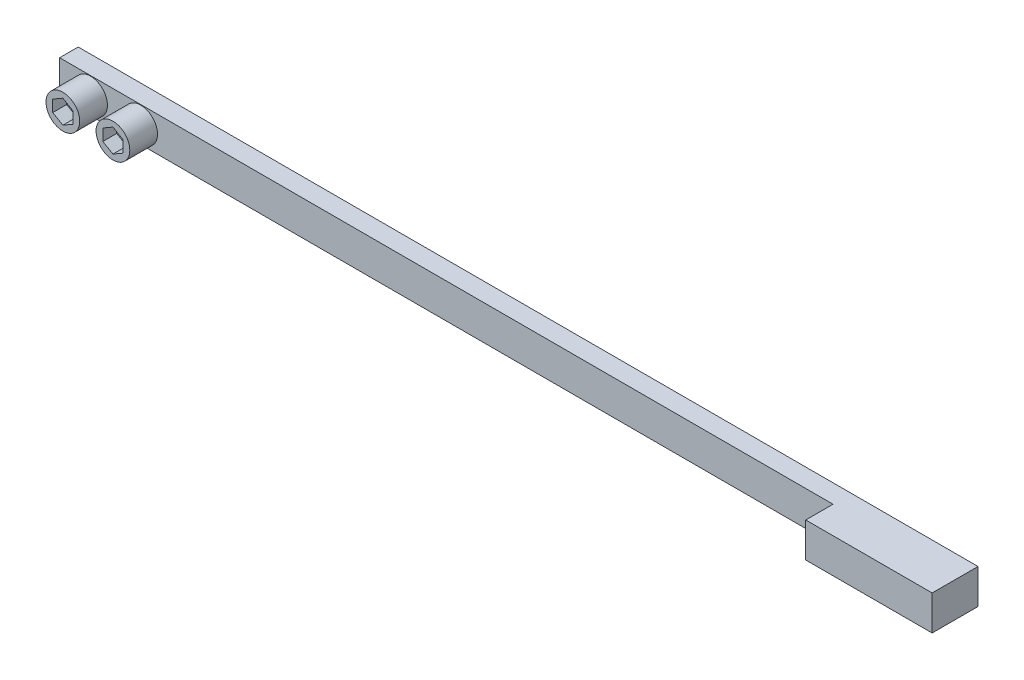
ISO-10303-21;
HEADER;
FILE_DESCRIPTION(('STEP AP214'),'2;1');
FILE_NAME('part.step','',(''),(''),'','','');
FILE_SCHEMA(('AUTOMOTIVE_DESIGN { 1 0 10303 214 1 1 1 1 }'));
ENDSEC;
DATA;
#1=APPLICATION_CONTEXT('core data for automotive mechanical design processes');
#2=APPLICATION_PROTOCOL_DEFINITION('international standard','automotive_design',2000,#1);
#3=PRODUCT_CONTEXT('',#1,'mechanical');
#4=PRODUCT('Part','Part','',(#3));
#5=PRODUCT_RELATED_PRODUCT_CATEGORY('part','',(#4));
#6=PRODUCT_DEFINITION_FORMATION('','',#4);
#7=PRODUCT_DEFINITION_CONTEXT('part definition',#1,'design');
#8=PRODUCT_DEFINITION('design','',#6,#7);
#9=PRODUCT_DEFINITION_SHAPE('','',#8);
#10=(LENGTH_UNIT() NAMED_UNIT(*) SI_UNIT(.MILLI.,.METRE.));
#11=(NAMED_UNIT(*) PLANE_ANGLE_UNIT() SI_UNIT($,.RADIAN.));
#12=(NAMED_UNIT(*) SI_UNIT($,.STERADIAN.) SOLID_ANGLE_UNIT());
#13=UNCERTAINTY_MEASURE_WITH_UNIT(LENGTH_MEASURE(1.E-05),#10,'distance_accuracy_value','');
#14=(GEOMETRIC_REPRESENTATION_CONTEXT(3) GLOBAL_UNCERTAINTY_ASSIGNED_CONTEXT((#13)) GLOBAL_UNIT_ASSIGNED_CONTEXT((#10,
#11,#12)) REPRESENTATION_CONTEXT('',''));
#15=CARTESIAN_POINT('',(0.,0.,0.));
#16=DIRECTION('',(0.,0.,1.));
#17=DIRECTION('',(1.,0.,0.));
#18=AXIS2_PLACEMENT_3D('',#15,#16,#17);
#19=CARTESIAN_POINT('',(-46.101,1.778,0.9525));
#20=DIRECTION('',(0.,0.,-1.));
#21=DIRECTION('',(-1.,0.,0.));
#22=AXIS2_PLACEMENT_3D('',#19,#20,#21);
#23=PLANE('',#22);
#24=CARTESIAN_POINT('',(-42.926,0.,0.9525));
#25=DIRECTION('',(0.,0.,-1.));
#26=DIRECTION('',(-1.,0.,0.));
#27=AXIS2_PLACEMENT_3D('',#24,#25,#26);
#28=CIRCLE('',#27,1.7272);
#29=CARTESIAN_POINT('',(-44.6532,0.,0.9525));
#30=VERTEX_POINT('',#29);
#31=EDGE_CURVE('E44',#30,#30,#28,.F.);
#32=ORIENTED_EDGE('',*,*,#31,.F.);
#33=EDGE_LOOP('',(#32));
#34=FACE_BOUND('',#33,.T.);
#35=DIRECTION('',(1.,0.,0.));
#36=VECTOR('',#35,1.);
#37=CARTESIAN_POINT('',(-46.101,-1.778,0.9525));
#38=LINE('',#37,#36);
#39=CARTESIAN_POINT('',(-46.101,-1.778,0.9525));
#40=VERTEX_POINT('',#39);
#41=CARTESIAN_POINT('',(33.147,-1.778,0.9525));
#42=VERTEX_POINT('',#41);
#43=EDGE_CURVE('E275',#40,#42,#38,.T.);
#44=ORIENTED_EDGE('',*,*,#43,.T.);
#45=DIRECTION('',(0.,-1.,0.));
#46=VECTOR('',#45,1.);
#47=CARTESIAN_POINT('',(33.147,1.778,0.9525));
#48=LINE('',#47,#46);
#49=CARTESIAN_POINT('',(33.147,1.778,0.9525));
#50=VERTEX_POINT('',#49);
#51=EDGE_CURVE('E305',#50,#42,#48,.T.);
#52=ORIENTED_EDGE('',*,*,#51,.F.);
#53=DIRECTION('',(1.,0.,0.));
#54=VECTOR('',#53,1.);
#55=CARTESIAN_POINT('',(-46.101,1.778,0.9525));
#56=LINE('',#55,#54);
#57=CARTESIAN_POINT('',(-46.101,1.778,0.9525));
#58=VERTEX_POINT('',#57);
#59=EDGE_CURVE('E288',#58,#50,#56,.T.);
#60=ORIENTED_EDGE('',*,*,#59,.F.);
#61=DIRECTION('',(0.,-1.,0.));
#62=VECTOR('',#61,1.);
#63=CARTESIAN_POINT('',(-46.101,1.778,0.9525));
#64=LINE('',#63,#62);
#65=EDGE_CURVE('E308',#58,#40,#64,.T.);
#66=ORIENTED_EDGE('',*,*,#65,.T.);
#67=EDGE_LOOP('',(#44,#52,#60,#66));
#68=FACE_BOUND('',#67,.T.);
#69=CARTESIAN_POINT('',(-37.7952,0.,0.9525));
#70=DIRECTION('',(0.,0.,-1.));
#71=DIRECTION('',(-1.,0.,0.));
#72=AXIS2_PLACEMENT_3D('',#69,#70,#71);
#73=CIRCLE('',#72,1.7272);
#74=CARTESIAN_POINT('',(-39.5224,0.,0.9525));
#75=VERTEX_POINT('',#74);
#76=EDGE_CURVE('E11',#75,#75,#73,.F.);
#77=ORIENTED_EDGE('',*,*,#76,.F.);
#78=EDGE_LOOP('',(#77));
#79=FACE_BOUND('',#78,.T.);
#80=ADVANCED_FACE('F36',(#34,#68,#79),#23,.F.);
#81=CARTESIAN_POINT('',(46.101,1.778,-0.9525));
#82=DIRECTION('',(0.,0.,1.));
#83=DIRECTION('',(1.,0.,0.));
#84=AXIS2_PLACEMENT_3D('',#81,#82,#83);
#85=PLANE('',#84);
#86=DIRECTION('',(-1.,0.,0.));
#87=VECTOR('',#86,1.);
#88=CARTESIAN_POINT('',(46.101,-1.778,-0.9525));
#89=LINE('',#88,#87);
#90=CARTESIAN_POINT('',(46.101,-1.778,-0.9525));
#91=VERTEX_POINT('',#90);
#92=CARTESIAN_POINT('',(-46.101,-1.778,-0.9525));
#93=VERTEX_POINT('',#92);
#94=EDGE_CURVE('E270',#91,#93,#89,.T.);
#95=ORIENTED_EDGE('',*,*,#94,.T.);
#96=DIRECTION('',(0.,-1.,0.));
#97=VECTOR('',#96,1.);
#98=CARTESIAN_POINT('',(-46.101,1.778,-0.9525));
#99=LINE('',#98,#97);
#100=CARTESIAN_POINT('',(-46.101,1.778,-0.9525));
#101=VERTEX_POINT('',#100);
#102=EDGE_CURVE('E311',#101,#93,#99,.T.);
#103=ORIENTED_EDGE('',*,*,#102,.F.);
#104=DIRECTION('',(-1.,0.,0.));
#105=VECTOR('',#104,1.);
#106=CARTESIAN_POINT('',(46.101,1.778,-0.9525));
#107=LINE('',#106,#105);
#108=CARTESIAN_POINT('',(46.101,1.778,-0.9525));
#109=VERTEX_POINT('',#108);
#110=EDGE_CURVE('E283',#109,#101,#107,.T.);
#111=ORIENTED_EDGE('',*,*,#110,.F.);
#112=DIRECTION('',(0.,-1.,0.));
#113=VECTOR('',#112,1.);
#114=CARTESIAN_POINT('',(46.101,1.778,-0.9525));
#115=LINE('',#114,#113);
#116=EDGE_CURVE('E296',#109,#91,#115,.T.);
#117=ORIENTED_EDGE('',*,*,#116,.T.);
#118=EDGE_LOOP('',(#95,#103,#111,#117));
#119=FACE_BOUND('',#118,.T.);
#120=ADVANCED_FACE('F38',(#119),#85,.F.);
#121=CARTESIAN_POINT('',(-46.101,1.778,-0.9525));
#122=DIRECTION('',(1.,0.,0.));
#123=DIRECTION('',(0.,0.,-1.));
#124=AXIS2_PLACEMENT_3D('',#121,#122,#123);
#125=PLANE('',#124);
#126=DIRECTION('',(0.,0.,1.));
#127=VECTOR('',#126,1.);
#128=CARTESIAN_POINT('',(-46.101,-1.778,-0.9525));
#129=LINE('',#128,#127);
#130=EDGE_CURVE('E273',#93,#40,#129,.T.);
#131=ORIENTED_EDGE('',*,*,#130,.T.);
#132=ORIENTED_EDGE('',*,*,#65,.F.);
#133=DIRECTION('',(0.,0.,1.));
#134=VECTOR('',#133,1.);
#135=CARTESIAN_POINT('',(-46.101,1.778,-0.9525));
#136=LINE('',#135,#134);
#137=EDGE_CURVE('E286',#101,#58,#136,.T.);
#138=ORIENTED_EDGE('',*,*,#137,.F.);
#139=ORIENTED_EDGE('',*,*,#102,.T.);
#140=EDGE_LOOP('',(#131,#132,#138,#139));
#141=FACE_BOUND('',#140,.T.);
#142=ADVANCED_FACE('F390',(#141),#125,.F.);
#143=CARTESIAN_POINT('',(33.147,1.778,0.9525));
#144=DIRECTION('',(1.,0.,0.));
#145=DIRECTION('',(0.,0.,-1.));
#146=AXIS2_PLACEMENT_3D('',#143,#144,#145);
#147=PLANE('',#146);
#148=DIRECTION('',(0.,0.,1.));
#149=VECTOR('',#148,1.);
#150=CARTESIAN_POINT('',(33.147,-1.778,0.9525));
#151=LINE('',#150,#149);
#152=CARTESIAN_POINT('',(33.147,-1.778,3.7465));
#153=VERTEX_POINT('',#152);
#154=EDGE_CURVE('E277',#42,#153,#151,.T.);
#155=ORIENTED_EDGE('',*,*,#154,.T.);
#156=DIRECTION('',(0.,-1.,0.));
#157=VECTOR('',#156,1.);
#158=CARTESIAN_POINT('',(33.147,1.778,3.7465));
#159=LINE('',#158,#157);
#160=CARTESIAN_POINT('',(33.147,1.778,3.7465));
#161=VERTEX_POINT('',#160);
#162=EDGE_CURVE('E302',#161,#153,#159,.T.);
#163=ORIENTED_EDGE('',*,*,#162,.F.);
#164=DIRECTION('',(0.,0.,1.));
#165=VECTOR('',#164,1.);
#166=CARTESIAN_POINT('',(33.147,1.778,0.9525));
#167=LINE('',#166,#165);
#168=EDGE_CURVE('E290',#50,#161,#167,.T.);
#169=ORIENTED_EDGE('',*,*,#168,.F.);
#170=ORIENTED_EDGE('',*,*,#51,.T.);
#171=EDGE_LOOP('',(#155,#163,#169,#170));
#172=FACE_BOUND('',#171,.T.);
#173=ADVANCED_FACE('F387',(#172),#147,.F.);
#174=CARTESIAN_POINT('',(33.147,1.778,3.7465));
#175=DIRECTION('',(0.,0.,-1.));
#176=DIRECTION('',(-1.,0.,0.));
#177=AXIS2_PLACEMENT_3D('',#174,#175,#176);
#178=PLANE('',#177);
#179=DIRECTION('',(1.,0.,0.));
#180=VECTOR('',#179,1.);
#181=CARTESIAN_POINT('',(33.147,-1.778,3.7465));
#182=LINE('',#181,#180);
#183=CARTESIAN_POINT('',(46.101,-1.778,3.7465));
#184=VERTEX_POINT('',#183);
#185=EDGE_CURVE('E279',#153,#184,#182,.T.);
#186=ORIENTED_EDGE('',*,*,#185,.T.);
#187=DIRECTION('',(0.,-1.,0.));
#188=VECTOR('',#187,1.);
#189=CARTESIAN_POINT('',(46.101,1.778,3.7465));
#190=LINE('',#189,#188);
#191=CARTESIAN_POINT('',(46.101,1.778,3.7465));
#192=VERTEX_POINT('',#191);
#193=EDGE_CURVE('E299',#192,#184,#190,.T.);
#194=ORIENTED_EDGE('',*,*,#193,.F.);
#195=DIRECTION('',(1.,0.,0.));
#196=VECTOR('',#195,1.);
#197=CARTESIAN_POINT('',(33.147,1.778,3.7465));
#198=LINE('',#197,#196);
#199=EDGE_CURVE('E292',#161,#192,#198,.T.);
#200=ORIENTED_EDGE('',*,*,#199,.F.);
#201=ORIENTED_EDGE('',*,*,#162,.T.);
#202=EDGE_LOOP('',(#186,#194,#200,#201));
#203=FACE_BOUND('',#202,.T.);
#204=ADVANCED_FACE('F383',(#203),#178,.F.);
#205=CARTESIAN_POINT('',(46.101,1.778,3.7465));
#206=DIRECTION('',(-1.,0.,0.));
#207=DIRECTION('',(0.,0.,1.));
#208=AXIS2_PLACEMENT_3D('',#205,#206,#207);
#209=PLANE('',#208);
#210=DIRECTION('',(0.,0.,-1.));
#211=VECTOR('',#210,1.);
#212=CARTESIAN_POINT('',(46.101,-1.778,3.7465));
#213=LINE('',#212,#211);
#214=EDGE_CURVE('E281',#184,#91,#213,.T.);
#215=ORIENTED_EDGE('',*,*,#214,.T.);
#216=ORIENTED_EDGE('',*,*,#116,.F.);
#217=DIRECTION('',(0.,0.,-1.));
#218=VECTOR('',#217,1.);
#219=CARTESIAN_POINT('',(46.101,1.778,3.7465));
#220=LINE('',#219,#218);
#221=EDGE_CURVE('E294',#192,#109,#220,.T.);
#222=ORIENTED_EDGE('',*,*,#221,.F.);
#223=ORIENTED_EDGE('',*,*,#193,.T.);
#224=EDGE_LOOP('',(#215,#216,#222,#223));
#225=FACE_BOUND('',#224,.T.);
#226=ADVANCED_FACE('F379',(#225),#209,.F.);
#227=CARTESIAN_POINT('',(-46.101,1.778,-0.9525));
#228=DIRECTION('',(0.,1.,0.));
#229=DIRECTION('',(0.,0.,1.));
#230=AXIS2_PLACEMENT_3D('',#227,#228,#229);
#231=PLANE('',#230);
#232=ORIENTED_EDGE('',*,*,#110,.T.);
#233=ORIENTED_EDGE('',*,*,#137,.T.);
#234=ORIENTED_EDGE('',*,*,#59,.T.);
#235=ORIENTED_EDGE('',*,*,#168,.T.);
#236=ORIENTED_EDGE('',*,*,#199,.T.);
#237=ORIENTED_EDGE('',*,*,#221,.T.);
#238=EDGE_LOOP('',(#232,#233,#234,#235,#236,#237));
#239=FACE_BOUND('',#238,.T.);
#240=ADVANCED_FACE('F375',(#239),#231,.T.);
#241=CARTESIAN_POINT('',(-46.101,-1.778,-0.9525));
#242=DIRECTION('',(0.,1.,0.));
#243=DIRECTION('',(0.,0.,1.));
#244=AXIS2_PLACEMENT_3D('',#241,#242,#243);
#245=PLANE('',#244);
#246=ORIENTED_EDGE('',*,*,#94,.F.);
#247=ORIENTED_EDGE('',*,*,#214,.F.);
#248=ORIENTED_EDGE('',*,*,#185,.F.);
#249=ORIENTED_EDGE('',*,*,#154,.F.);
#250=ORIENTED_EDGE('',*,*,#43,.F.);
#251=ORIENTED_EDGE('',*,*,#130,.F.);
#252=EDGE_LOOP('',(#246,#247,#248,#249,#250,#251));
#253=FACE_BOUND('',#252,.T.);
#254=ADVANCED_FACE('F371',(#253),#245,.F.);
#255=CARTESIAN_POINT('',(-42.926,0.,3.7973));
#256=DIRECTION('',(0.,0.,-1.));
#257=DIRECTION('',(-1.,0.,0.));
#258=AXIS2_PLACEMENT_3D('',#255,#256,#257);
#259=CYLINDRICAL_SURFACE('',#258,1.7272);
#260=CARTESIAN_POINT('',(-42.926,0.,3.7973));
#261=DIRECTION('',(0.,0.,1.));
#262=DIRECTION('',(1.,0.,0.));
#263=AXIS2_PLACEMENT_3D('',#260,#261,#262);
#264=CIRCLE('',#263,1.7272);
#265=CARTESIAN_POINT('',(-41.1988,0.,3.7973));
#266=VERTEX_POINT('',#265);
#267=EDGE_CURVE('E258',#266,#266,#264,.T.);
#268=ORIENTED_EDGE('',*,*,#267,.F.);
#269=EDGE_LOOP('',(#268));
#270=FACE_BOUND('',#269,.T.);
#271=ORIENTED_EDGE('',*,*,#31,.T.);
#272=EDGE_LOOP('',(#271));
#273=FACE_BOUND('',#272,.T.);
#274=ADVANCED_FACE('F316',(#270,#273),#259,.T.);
#275=CARTESIAN_POINT('',(-42.926,0.,3.7973));
#276=DIRECTION('',(0.,0.,1.));
#277=DIRECTION('',(1.,0.,0.));
#278=AXIS2_PLACEMENT_3D('',#275,#276,#277);
#279=PLANE('',#278);
#280=DIRECTION('',(-0.866025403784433,-0.500000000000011,0.));
#281=VECTOR('',#280,1.);
#282=CARTESIAN_POINT('',(-42.926,1.1966392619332,3.7973));
#283=LINE('',#282,#281);
#284=CARTESIAN_POINT('',(-42.926,1.1966392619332,3.7973));
#285=VERTEX_POINT('',#284);
#286=CARTESIAN_POINT('',(-43.96232,0.59831963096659,3.7973));
#287=VERTEX_POINT('',#286);
#288=EDGE_CURVE('E59',#285,#287,#283,.T.);
#289=ORIENTED_EDGE('',*,*,#288,.F.);
#290=DIRECTION('',(-0.866025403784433,0.500000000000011,0.));
#291=VECTOR('',#290,1.);
#292=CARTESIAN_POINT('',(-41.88968,0.59831963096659,3.7973));
#293=LINE('',#292,#291);
#294=CARTESIAN_POINT('',(-41.88968,0.59831963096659,3.7973));
#295=VERTEX_POINT('',#294);
#296=EDGE_CURVE('E234',#295,#285,#293,.T.);
#297=ORIENTED_EDGE('',*,*,#296,.F.);
#298=DIRECTION('',(0.,1.,0.));
#299=VECTOR('',#298,1.);
#300=CARTESIAN_POINT('',(-41.88968,-0.59831963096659,3.7973));
#301=LINE('',#300,#299);
#302=CARTESIAN_POINT('',(-41.88968,-0.59831963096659,3.7973));
#303=VERTEX_POINT('',#302);
#304=EDGE_CURVE('E231',#303,#295,#301,.T.);
#305=ORIENTED_EDGE('',*,*,#304,.F.);
#306=DIRECTION('',(0.866025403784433,0.500000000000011,0.));
#307=VECTOR('',#306,1.);
#308=CARTESIAN_POINT('',(-42.926,-1.1966392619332,3.7973));
#309=LINE('',#308,#307);
#310=CARTESIAN_POINT('',(-42.926,-1.1966392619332,3.7973));
#311=VERTEX_POINT('',#310);
#312=EDGE_CURVE('E228',#311,#303,#309,.T.);
#313=ORIENTED_EDGE('',*,*,#312,.F.);
#314=DIRECTION('',(0.866025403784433,-0.500000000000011,0.));
#315=VECTOR('',#314,1.);
#316=CARTESIAN_POINT('',(-43.96232,-0.59831963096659,3.7973));
#317=LINE('',#316,#315);
#318=CARTESIAN_POINT('',(-43.96232,-0.59831963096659,3.7973));
#319=VERTEX_POINT('',#318);
#320=EDGE_CURVE('E225',#319,#311,#317,.T.);
#321=ORIENTED_EDGE('',*,*,#320,.F.);
#322=DIRECTION('',(0.,-1.,0.));
#323=VECTOR('',#322,1.);
#324=CARTESIAN_POINT('',(-43.96232,0.59831963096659,3.7973));
#325=LINE('',#324,#323);
#326=EDGE_CURVE('E222',#287,#319,#325,.T.);
#327=ORIENTED_EDGE('',*,*,#326,.F.);
#328=EDGE_LOOP('',(#289,#297,#305,#313,#321,#327));
#329=FACE_BOUND('',#328,.T.);
#330=ORIENTED_EDGE('',*,*,#267,.T.);
#331=EDGE_LOOP('',(#330));
#332=FACE_BOUND('',#331,.T.);
#333=ADVANCED_FACE('F365',(#329,#332),#279,.T.);
#334=CARTESIAN_POINT('',(-42.926,1.1966392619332,2.3749));
#335=DIRECTION('',(-0.500000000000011,0.866025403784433,0.));
#336=DIRECTION('',(-0.866025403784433,-0.500000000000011,0.));
#337=AXIS2_PLACEMENT_3D('',#334,#335,#336);
#338=PLANE('',#337);
#339=ORIENTED_EDGE('',*,*,#288,.T.);
#340=DIRECTION('',(0.,0.,1.));
#341=VECTOR('',#340,1.);
#342=CARTESIAN_POINT('',(-43.96232,0.59831963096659,2.3749));
#343=LINE('',#342,#341);
#344=CARTESIAN_POINT('',(-43.96232,0.59831963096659,2.3749));
#345=VERTEX_POINT('',#344);
#346=EDGE_CURVE('E255',#345,#287,#343,.T.);
#347=ORIENTED_EDGE('',*,*,#346,.F.);
#348=DIRECTION('',(-0.866025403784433,-0.500000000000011,0.));
#349=VECTOR('',#348,1.);
#350=CARTESIAN_POINT('',(-42.926,1.1966392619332,2.3749));
#351=LINE('',#350,#349);
#352=CARTESIAN_POINT('',(-42.926,1.1966392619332,2.3749));
#353=VERTEX_POINT('',#352);
#354=EDGE_CURVE('E237',#353,#345,#351,.T.);
#355=ORIENTED_EDGE('',*,*,#354,.F.);
#356=DIRECTION('',(0.,0.,1.));
#357=VECTOR('',#356,1.);
#358=CARTESIAN_POINT('',(-42.926,1.1966392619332,2.3749));
#359=LINE('',#358,#357);
#360=EDGE_CURVE('E256',#353,#285,#359,.T.);
#361=ORIENTED_EDGE('',*,*,#360,.T.);
#362=EDGE_LOOP('',(#339,#347,#355,#361));
#363=FACE_BOUND('',#362,.T.);
#364=ADVANCED_FACE('F347',(#363),#338,.F.);
#365=CARTESIAN_POINT('',(-41.88968,0.59831963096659,2.3749));
#366=DIRECTION('',(0.500000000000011,0.866025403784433,0.));
#367=DIRECTION('',(-0.866025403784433,0.500000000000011,0.));
#368=AXIS2_PLACEMENT_3D('',#365,#366,#367);
#369=PLANE('',#368);
#370=ORIENTED_EDGE('',*,*,#296,.T.);
#371=ORIENTED_EDGE('',*,*,#360,.F.);
#372=DIRECTION('',(-0.866025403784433,0.500000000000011,0.));
#373=VECTOR('',#372,1.);
#374=CARTESIAN_POINT('',(-41.88968,0.59831963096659,2.3749));
#375=LINE('',#374,#373);
#376=CARTESIAN_POINT('',(-41.88968,0.59831963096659,2.3749));
#377=VERTEX_POINT('',#376);
#378=EDGE_CURVE('E252',#377,#353,#375,.T.);
#379=ORIENTED_EDGE('',*,*,#378,.F.);
#380=DIRECTION('',(0.,0.,1.));
#381=VECTOR('',#380,1.);
#382=CARTESIAN_POINT('',(-41.88968,0.59831963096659,2.3749));
#383=LINE('',#382,#381);
#384=EDGE_CURVE('E259',#377,#295,#383,.T.);
#385=ORIENTED_EDGE('',*,*,#384,.T.);
#386=EDGE_LOOP('',(#370,#371,#379,#385));
#387=FACE_BOUND('',#386,.T.);
#388=ADVANCED_FACE('F343',(#387),#369,.F.);
#389=CARTESIAN_POINT('',(-41.88968,-0.59831963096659,2.3749));
#390=DIRECTION('',(1.,0.,0.));
#391=DIRECTION('',(0.,0.,-1.));
#392=AXIS2_PLACEMENT_3D('',#389,#390,#391);
#393=PLANE('',#392);
#394=ORIENTED_EDGE('',*,*,#304,.T.);
#395=ORIENTED_EDGE('',*,*,#384,.F.);
#396=DIRECTION('',(0.,1.,0.));
#397=VECTOR('',#396,1.);
#398=CARTESIAN_POINT('',(-41.88968,-0.59831963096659,2.3749));
#399=LINE('',#398,#397);
#400=CARTESIAN_POINT('',(-41.88968,-0.59831963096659,2.3749));
#401=VERTEX_POINT('',#400);
#402=EDGE_CURVE('E249',#401,#377,#399,.T.);
#403=ORIENTED_EDGE('',*,*,#402,.F.);
#404=DIRECTION('',(0.,0.,1.));
#405=VECTOR('',#404,1.);
#406=CARTESIAN_POINT('',(-41.88968,-0.59831963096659,2.3749));
#407=LINE('',#406,#405);
#408=EDGE_CURVE('E261',#401,#303,#407,.T.);
#409=ORIENTED_EDGE('',*,*,#408,.T.);
#410=EDGE_LOOP('',(#394,#395,#403,#409));
#411=FACE_BOUND('',#410,.T.);
#412=ADVANCED_FACE('F346',(#411),#393,.F.);
#413=CARTESIAN_POINT('',(-42.926,-1.1966392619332,2.3749));
#414=DIRECTION('',(0.500000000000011,-0.866025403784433,0.));
#415=DIRECTION('',(0.866025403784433,0.500000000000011,0.));
#416=AXIS2_PLACEMENT_3D('',#413,#414,#415);
#417=PLANE('',#416);
#418=ORIENTED_EDGE('',*,*,#312,.T.);
#419=ORIENTED_EDGE('',*,*,#408,.F.);
#420=DIRECTION('',(0.866025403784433,0.500000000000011,0.));
#421=VECTOR('',#420,1.);
#422=CARTESIAN_POINT('',(-42.926,-1.1966392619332,2.3749));
#423=LINE('',#422,#421);
#424=CARTESIAN_POINT('',(-42.926,-1.1966392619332,2.3749));
#425=VERTEX_POINT('',#424);
#426=EDGE_CURVE('E246',#425,#401,#423,.T.);
#427=ORIENTED_EDGE('',*,*,#426,.F.);
#428=DIRECTION('',(0.,0.,1.));
#429=VECTOR('',#428,1.);
#430=CARTESIAN_POINT('',(-42.926,-1.1966392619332,2.3749));
#431=LINE('',#430,#429);
#432=EDGE_CURVE('E263',#425,#311,#431,.T.);
#433=ORIENTED_EDGE('',*,*,#432,.T.);
#434=EDGE_LOOP('',(#418,#419,#427,#433));
#435=FACE_BOUND('',#434,.T.);
#436=ADVANCED_FACE('F351',(#435),#417,.F.);
#437=CARTESIAN_POINT('',(-43.96232,-0.59831963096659,2.3749));
#438=DIRECTION('',(-0.500000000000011,-0.866025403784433,0.));
#439=DIRECTION('',(0.866025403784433,-0.500000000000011,0.));
#440=AXIS2_PLACEMENT_3D('',#437,#438,#439);
#441=PLANE('',#440);
#442=ORIENTED_EDGE('',*,*,#320,.T.);
#443=ORIENTED_EDGE('',*,*,#432,.F.);
#444=DIRECTION('',(0.866025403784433,-0.500000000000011,0.));
#445=VECTOR('',#444,1.);
#446=CARTESIAN_POINT('',(-43.96232,-0.59831963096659,2.3749));
#447=LINE('',#446,#445);
#448=CARTESIAN_POINT('',(-43.96232,-0.59831963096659,2.3749));
#449=VERTEX_POINT('',#448);
#450=EDGE_CURVE('E243',#449,#425,#447,.T.);
#451=ORIENTED_EDGE('',*,*,#450,.F.);
#452=DIRECTION('',(0.,0.,1.));
#453=VECTOR('',#452,1.);
#454=CARTESIAN_POINT('',(-43.96232,-0.59831963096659,2.3749));
#455=LINE('',#454,#453);
#456=EDGE_CURVE('E265',#449,#319,#455,.T.);
#457=ORIENTED_EDGE('',*,*,#456,.T.);
#458=EDGE_LOOP('',(#442,#443,#451,#457));
#459=FACE_BOUND('',#458,.T.);
#460=ADVANCED_FACE('F355',(#459),#441,.F.);
#461=CARTESIAN_POINT('',(-43.96232,0.59831963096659,2.3749));
#462=DIRECTION('',(-1.,0.,0.));
#463=DIRECTION('',(0.,0.,1.));
#464=AXIS2_PLACEMENT_3D('',#461,#462,#463);
#465=PLANE('',#464);
#466=ORIENTED_EDGE('',*,*,#326,.T.);
#467=ORIENTED_EDGE('',*,*,#456,.F.);
#468=DIRECTION('',(0.,-1.,0.));
#469=VECTOR('',#468,1.);
#470=CARTESIAN_POINT('',(-43.96232,0.59831963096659,2.3749));
#471=LINE('',#470,#469);
#472=EDGE_CURVE('E240',#345,#449,#471,.T.);
#473=ORIENTED_EDGE('',*,*,#472,.F.);
#474=ORIENTED_EDGE('',*,*,#346,.T.);
#475=EDGE_LOOP('',(#466,#467,#473,#474));
#476=FACE_BOUND('',#475,.T.);
#477=ADVANCED_FACE('F337',(#476),#465,.F.);
#478=CARTESIAN_POINT('',(-44.99864,0.,2.3749));
#479=DIRECTION('',(0.,0.,1.));
#480=DIRECTION('',(1.,0.,0.));
#481=AXIS2_PLACEMENT_3D('',#478,#479,#480);
#482=PLANE('',#481);
#483=ORIENTED_EDGE('',*,*,#354,.T.);
#484=ORIENTED_EDGE('',*,*,#472,.T.);
#485=ORIENTED_EDGE('',*,*,#450,.T.);
#486=ORIENTED_EDGE('',*,*,#426,.T.);
#487=ORIENTED_EDGE('',*,*,#402,.T.);
#488=ORIENTED_EDGE('',*,*,#378,.T.);
#489=EDGE_LOOP('',(#483,#484,#485,#486,#487,#488));
#490=FACE_BOUND('',#489,.T.);
#491=ADVANCED_FACE('F328',(#490),#482,.T.);
#492=CARTESIAN_POINT('',(-37.7952,0.,3.7973));
#493=DIRECTION('',(0.,0.,-1.));
#494=DIRECTION('',(-1.,0.,0.));
#495=AXIS2_PLACEMENT_3D('',#492,#493,#494);
#496=CYLINDRICAL_SURFACE('',#495,1.7272);
#497=CARTESIAN_POINT('',(-37.7952,0.,3.7973));
#498=DIRECTION('',(0.,0.,1.));
#499=DIRECTION('',(1.,0.,0.));
#500=AXIS2_PLACEMENT_3D('',#497,#498,#499);
#501=CIRCLE('',#500,1.7272);
#502=CARTESIAN_POINT('',(-36.068,0.,3.7973));
#503=VERTEX_POINT('',#502);
#504=EDGE_CURVE('E212',#503,#503,#501,.T.);
#505=ORIENTED_EDGE('',*,*,#504,.F.);
#506=EDGE_LOOP('',(#505));
#507=FACE_BOUND('',#506,.T.);
#508=ORIENTED_EDGE('',*,*,#76,.T.);
#509=EDGE_LOOP('',(#508));
#510=FACE_BOUND('',#509,.T.);
#511=ADVANCED_FACE('F326',(#507,#510),#496,.T.);
#512=CARTESIAN_POINT('',(-37.7952,0.,3.7973));
#513=DIRECTION('',(0.,0.,1.));
#514=DIRECTION('',(1.,0.,0.));
#515=AXIS2_PLACEMENT_3D('',#512,#513,#514);
#516=PLANE('',#515);
#517=DIRECTION('',(-0.866025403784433,-0.500000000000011,0.));
#518=VECTOR('',#517,1.);
#519=CARTESIAN_POINT('',(-37.7952,1.1966392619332,3.7973));
#520=LINE('',#519,#518);
#521=CARTESIAN_POINT('',(-37.7952,1.1966392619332,3.7973));
#522=VERTEX_POINT('',#521);
#523=CARTESIAN_POINT('',(-38.83152,0.59831963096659,3.7973));
#524=VERTEX_POINT('',#523);
#525=EDGE_CURVE('E51',#522,#524,#520,.T.);
#526=ORIENTED_EDGE('',*,*,#525,.F.);
#527=DIRECTION('',(-0.866025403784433,0.500000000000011,0.));
#528=VECTOR('',#527,1.);
#529=CARTESIAN_POINT('',(-36.75888,0.59831963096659,3.7973));
#530=LINE('',#529,#528);
#531=CARTESIAN_POINT('',(-36.75888,0.59831963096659,3.7973));
#532=VERTEX_POINT('',#531);
#533=EDGE_CURVE('E192',#532,#522,#530,.T.);
#534=ORIENTED_EDGE('',*,*,#533,.F.);
#535=DIRECTION('',(0.,1.,0.));
#536=VECTOR('',#535,1.);
#537=CARTESIAN_POINT('',(-36.75888,-0.59831963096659,3.7973));
#538=LINE('',#537,#536);
#539=CARTESIAN_POINT('',(-36.75888,-0.59831963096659,3.7973));
#540=VERTEX_POINT('',#539);
#541=EDGE_CURVE('E186',#540,#532,#538,.T.);
#542=ORIENTED_EDGE('',*,*,#541,.F.);
#543=DIRECTION('',(0.866025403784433,0.500000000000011,0.));
#544=VECTOR('',#543,1.);
#545=CARTESIAN_POINT('',(-37.7952,-1.1966392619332,3.7973));
#546=LINE('',#545,#544);
#547=CARTESIAN_POINT('',(-37.7952,-1.1966392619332,3.7973));
#548=VERTEX_POINT('',#547);
#549=EDGE_CURVE('E184',#548,#540,#546,.T.);
#550=ORIENTED_EDGE('',*,*,#549,.F.);
#551=DIRECTION('',(0.866025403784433,-0.500000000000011,0.));
#552=VECTOR('',#551,1.);
#553=CARTESIAN_POINT('',(-38.83152,-0.59831963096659,3.7973));
#554=LINE('',#553,#552);
#555=CARTESIAN_POINT('',(-38.83152,-0.59831963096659,3.7973));
#556=VERTEX_POINT('',#555);
#557=EDGE_CURVE('E165',#556,#548,#554,.T.);
#558=ORIENTED_EDGE('',*,*,#557,.F.);
#559=DIRECTION('',(0.,-1.,0.));
#560=VECTOR('',#559,1.);
#561=CARTESIAN_POINT('',(-38.83152,0.59831963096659,3.7973));
#562=LINE('',#561,#560);
#563=EDGE_CURVE('E176',#524,#556,#562,.T.);
#564=ORIENTED_EDGE('',*,*,#563,.F.);
#565=EDGE_LOOP('',(#526,#534,#542,#550,#558,#564));
#566=FACE_BOUND('',#565,.T.);
#567=ORIENTED_EDGE('',*,*,#504,.T.);
#568=EDGE_LOOP('',(#567));
#569=FACE_BOUND('',#568,.T.);
#570=ADVANCED_FACE('F180',(#566,#569),#516,.T.);
#571=CARTESIAN_POINT('',(-37.7952,1.1966392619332,2.3749));
#572=DIRECTION('',(-0.500000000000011,0.866025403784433,0.));
#573=DIRECTION('',(-0.866025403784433,-0.500000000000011,0.));
#574=AXIS2_PLACEMENT_3D('',#571,#572,#573);
#575=PLANE('',#574);
#576=ORIENTED_EDGE('',*,*,#525,.T.);
#577=DIRECTION('',(0.,0.,1.));
#578=VECTOR('',#577,1.);
#579=CARTESIAN_POINT('',(-38.83152,0.59831963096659,2.3749));
#580=LINE('',#579,#578);
#581=CARTESIAN_POINT('',(-38.83152,0.59831963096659,2.3749));
#582=VERTEX_POINT('',#581);
#583=EDGE_CURVE('E173',#582,#524,#580,.T.);
#584=ORIENTED_EDGE('',*,*,#583,.F.);
#585=DIRECTION('',(-0.866025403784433,-0.500000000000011,0.));
#586=VECTOR('',#585,1.);
#587=CARTESIAN_POINT('',(-37.7952,1.1966392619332,2.3749));
#588=LINE('',#587,#586);
#589=CARTESIAN_POINT('',(-37.7952,1.1966392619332,2.3749));
#590=VERTEX_POINT('',#589);
#591=EDGE_CURVE('E195',#590,#582,#588,.T.);
#592=ORIENTED_EDGE('',*,*,#591,.F.);
#593=DIRECTION('',(0.,0.,1.));
#594=VECTOR('',#593,1.);
#595=CARTESIAN_POINT('',(-37.7952,1.1966392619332,2.3749));
#596=LINE('',#595,#594);
#597=EDGE_CURVE('E210',#590,#522,#596,.T.);
#598=ORIENTED_EDGE('',*,*,#597,.T.);
#599=EDGE_LOOP('',(#576,#584,#592,#598));
#600=FACE_BOUND('',#599,.T.);
#601=ADVANCED_FACE('F335',(#600),#575,.F.);
#602=CARTESIAN_POINT('',(-36.75888,0.59831963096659,2.3749));
#603=DIRECTION('',(0.500000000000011,0.866025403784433,0.));
#604=DIRECTION('',(-0.866025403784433,0.500000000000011,0.));
#605=AXIS2_PLACEMENT_3D('',#602,#603,#604);
#606=PLANE('',#605);
#607=ORIENTED_EDGE('',*,*,#533,.T.);
#608=ORIENTED_EDGE('',*,*,#597,.F.);
#609=DIRECTION('',(-0.866025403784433,0.500000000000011,0.));
#610=VECTOR('',#609,1.);
#611=CARTESIAN_POINT('',(-36.75888,0.59831963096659,2.3749));
#612=LINE('',#611,#610);
#613=CARTESIAN_POINT('',(-36.75888,0.59831963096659,2.3749));
#614=VERTEX_POINT('',#613);
#615=EDGE_CURVE('E207',#614,#590,#612,.T.);
#616=ORIENTED_EDGE('',*,*,#615,.F.);
#617=DIRECTION('',(0.,0.,1.));
#618=VECTOR('',#617,1.);
#619=CARTESIAN_POINT('',(-36.75888,0.59831963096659,2.3749));
#620=LINE('',#619,#618);
#621=EDGE_CURVE('E213',#614,#532,#620,.T.);
#622=ORIENTED_EDGE('',*,*,#621,.T.);
#623=EDGE_LOOP('',(#607,#608,#616,#622));
#624=FACE_BOUND('',#623,.T.);
#625=ADVANCED_FACE('F441',(#624),#606,.F.);
#626=CARTESIAN_POINT('',(-36.75888,-0.59831963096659,2.3749));
#627=DIRECTION('',(1.,0.,0.));
#628=DIRECTION('',(0.,0.,-1.));
#629=AXIS2_PLACEMENT_3D('',#626,#627,#628);
#630=PLANE('',#629);
#631=ORIENTED_EDGE('',*,*,#541,.T.);
#632=ORIENTED_EDGE('',*,*,#621,.F.);
#633=DIRECTION('',(0.,1.,0.));
#634=VECTOR('',#633,1.);
#635=CARTESIAN_POINT('',(-36.75888,-0.59831963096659,2.3749));
#636=LINE('',#635,#634);
#637=CARTESIAN_POINT('',(-36.75888,-0.59831963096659,2.3749));
#638=VERTEX_POINT('',#637);
#639=EDGE_CURVE('E204',#638,#614,#636,.T.);
#640=ORIENTED_EDGE('',*,*,#639,.F.);
#641=DIRECTION('',(0.,0.,1.));
#642=VECTOR('',#641,1.);
#643=CARTESIAN_POINT('',(-36.75888,-0.59831963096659,2.3749));
#644=LINE('',#643,#642);
#645=EDGE_CURVE('E215',#638,#540,#644,.T.);
#646=ORIENTED_EDGE('',*,*,#645,.T.);
#647=EDGE_LOOP('',(#631,#632,#640,#646));
#648=FACE_BOUND('',#647,.T.);
#649=ADVANCED_FACE('F449',(#648),#630,.F.);
#650=CARTESIAN_POINT('',(-37.7952,-1.1966392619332,2.3749));
#651=DIRECTION('',(0.500000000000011,-0.866025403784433,0.));
#652=DIRECTION('',(0.866025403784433,0.500000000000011,0.));
#653=AXIS2_PLACEMENT_3D('',#650,#651,#652);
#654=PLANE('',#653);
#655=ORIENTED_EDGE('',*,*,#549,.T.);
#656=ORIENTED_EDGE('',*,*,#645,.F.);
#657=DIRECTION('',(0.866025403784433,0.500000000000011,0.));
#658=VECTOR('',#657,1.);
#659=CARTESIAN_POINT('',(-37.7952,-1.1966392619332,2.3749));
#660=LINE('',#659,#658);
#661=CARTESIAN_POINT('',(-37.7952,-1.1966392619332,2.3749));
#662=VERTEX_POINT('',#661);
#663=EDGE_CURVE('E201',#662,#638,#660,.T.);
#664=ORIENTED_EDGE('',*,*,#663,.F.);
#665=DIRECTION('',(0.,0.,1.));
#666=VECTOR('',#665,1.);
#667=CARTESIAN_POINT('',(-37.7952,-1.1966392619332,2.3749));
#668=LINE('',#667,#666);
#669=EDGE_CURVE('E172',#662,#548,#668,.T.);
#670=ORIENTED_EDGE('',*,*,#669,.T.);
#671=EDGE_LOOP('',(#655,#656,#664,#670));
#672=FACE_BOUND('',#671,.T.);
#673=ADVANCED_FACE('F459',(#672),#654,.F.);
#674=CARTESIAN_POINT('',(-38.83152,-0.59831963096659,2.3749));
#675=DIRECTION('',(-0.500000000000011,-0.866025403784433,0.));
#676=DIRECTION('',(0.866025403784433,-0.500000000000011,0.));
#677=AXIS2_PLACEMENT_3D('',#674,#675,#676);
#678=PLANE('',#677);
#679=ORIENTED_EDGE('',*,*,#557,.T.);
#680=ORIENTED_EDGE('',*,*,#669,.F.);
#681=DIRECTION('',(0.866025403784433,-0.500000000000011,0.));
#682=VECTOR('',#681,1.);
#683=CARTESIAN_POINT('',(-38.83152,-0.59831963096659,2.3749));
#684=LINE('',#683,#682);
#685=CARTESIAN_POINT('',(-38.83152,-0.59831963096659,2.3749));
#686=VERTEX_POINT('',#685);
#687=EDGE_CURVE('E168',#686,#662,#684,.T.);
#688=ORIENTED_EDGE('',*,*,#687,.F.);
#689=DIRECTION('',(0.,0.,1.));
#690=VECTOR('',#689,1.);
#691=CARTESIAN_POINT('',(-38.83152,-0.59831963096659,2.3749));
#692=LINE('',#691,#690);
#693=EDGE_CURVE('E161',#686,#556,#692,.T.);
#694=ORIENTED_EDGE('',*,*,#693,.T.);
#695=EDGE_LOOP('',(#679,#680,#688,#694));
#696=FACE_BOUND('',#695,.T.);
#697=ADVANCED_FACE('F163',(#696),#678,.F.);
#698=CARTESIAN_POINT('',(-38.83152,0.59831963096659,2.3749));
#699=DIRECTION('',(-1.,0.,0.));
#700=DIRECTION('',(0.,0.,1.));
#701=AXIS2_PLACEMENT_3D('',#698,#699,#700);
#702=PLANE('',#701);
#703=ORIENTED_EDGE('',*,*,#563,.T.);
#704=ORIENTED_EDGE('',*,*,#693,.F.);
#705=DIRECTION('',(0.,-1.,0.));
#706=VECTOR('',#705,1.);
#707=CARTESIAN_POINT('',(-38.83152,0.59831963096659,2.3749));
#708=LINE('',#707,#706);
#709=EDGE_CURVE('E198',#582,#686,#708,.T.);
#710=ORIENTED_EDGE('',*,*,#709,.F.);
#711=ORIENTED_EDGE('',*,*,#583,.T.);
#712=EDGE_LOOP('',(#703,#704,#710,#711));
#713=FACE_BOUND('',#712,.T.);
#714=ADVANCED_FACE('F177',(#713),#702,.F.);
#715=CARTESIAN_POINT('',(-39.86784,0.,2.3749));
#716=DIRECTION('',(0.,0.,1.));
#717=DIRECTION('',(1.,0.,0.));
#718=AXIS2_PLACEMENT_3D('',#715,#716,#717);
#719=PLANE('',#718);
#720=ORIENTED_EDGE('',*,*,#591,.T.);
#721=ORIENTED_EDGE('',*,*,#709,.T.);
#722=ORIENTED_EDGE('',*,*,#687,.T.);
#723=ORIENTED_EDGE('',*,*,#663,.T.);
#724=ORIENTED_EDGE('',*,*,#639,.T.);
#725=ORIENTED_EDGE('',*,*,#615,.T.);
#726=EDGE_LOOP('',(#720,#721,#722,#723,#724,#725));
#727=FACE_BOUND('',#726,.T.);
#728=ADVANCED_FACE('F486',(#727),#719,.T.);
#729=CLOSED_SHELL('',(#80,#120,#142,#173,#204,#226,#240,#254,#274,#333,#364,#388,#412,#436,#460,
#477,#491,#511,#570,#601,#625,#649,#673,#697,#714,#728));
#730=MANIFOLD_SOLID_BREP('B2',#729);
#731=ADVANCED_BREP_SHAPE_REPRESENTATION('',(#18,#730),#14);
#732=SHAPE_DEFINITION_REPRESENTATION(#9,#731);
ENDSEC;
END-ISO-10303-21;
